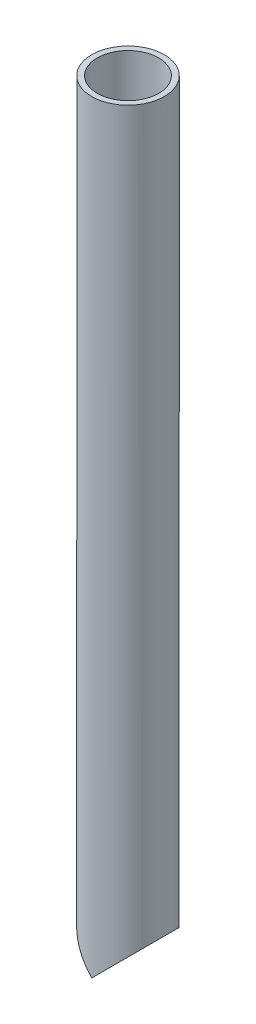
from build123d import *

# Parameters (mm, degrees)
SKETCH3_R          = 24.13
SKETCH3_R_2        = 20.447
EXTRUDE2_DEPTH     = 508
SKETCH4_R          = 24.13
CUT_EXTRUDE1_DEPTH = 38.1


with BuildPart() as part:
    # Sketch3 → Extrude2 (new body)
    with BuildSketch(Plane(origin=(0, 0, 0), x_dir=(-1, 0, 0), z_dir=(0, 1, 0))):
        with Locations(Location((0, 0, 0), (0, 0, 90))):
            Circle(SKETCH3_R)
        with Locations(Location((0, 0, 0), (0, 0, 90))):
            Circle(SKETCH3_R_2, mode=Mode.SUBTRACT)
    extrude(amount=EXTRUDE2_DEPTH)

    # Sketch4 → Cut-Extrude1 (cut, symmetric)
    with BuildSketch(Plane(origin=(0, 0, -63.5), x_dir=(0, 0, -1), z_dir=(1, 0, 0))):
        with Locations((-63.5, 0)):
            Circle(SKETCH4_R)
    extrude(amount=CUT_EXTRUDE1_DEPTH, both=True, mode=Mode.SUBTRACT)


solid = part.part
